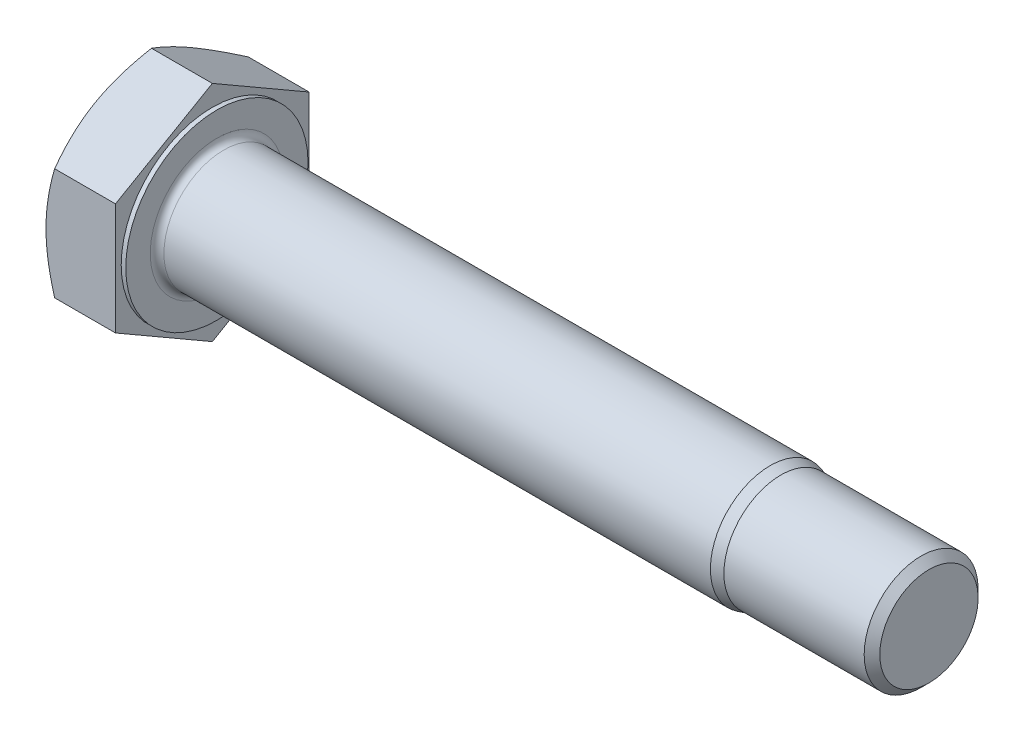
from build123d import *

# Parameters (mm, degrees)
BASEHEAD_DEPTH = 13
SKETCH4_W      = 0.8
SKETCH4_H      = 3.629909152
HEADFILLET_R   = 1.2


with BuildPart() as part:
    # HeadSke → BaseHead (new body)
    with BuildSketch(Plane(origin=(0, 0, 0), x_dir=(0, 0, -1), z_dir=(1, 0, 0))):
        Polygon((17, 9.814954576), (17, -9.814954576), (0, -19.629909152), (-17, -9.814954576), (-17, 9.814954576), (0, 19.629909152), align=None)
    extrude(amount=BASEHEAD_DEPTH)

    # BodySke → BaseBody (revolve)
    with BuildSketch(Plane.XY, mode=Mode.PRIVATE) as basebody_sk:
        Polygon((0, 10.5), (0, 0), (138, 0), (138, 8.626), (136.626, 10), (112, 10), (110.133974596, 10.5), align=None)
    revolve(basebody_sk.sketch.rotate(Axis((0, 0, 0), (1, 0, 0)), 90), axis=Axis((0, 0, 0), (1, 0, 0)))

    # Sketch3 → HeadChamfer (revolve, cut)
    with BuildSketch(Plane(origin=(0, 0, 0), x_dir=(1, 0, 0), z_dir=(0, 1, 0))):
        Polygon((4.25, 24.361215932), (-4.25, 9.638784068), (-11.424013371, 13.780702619), (-2.924013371, 28.503134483), align=None)
    revolve(axis=Axis((0, 0, 0), (1, 0, 0)), mode=Mode.SUBTRACT)

    # Sketch4 → BearingFace (revolve, cut)
    with BuildSketch(Plane.XY, mode=Mode.PRIVATE) as bearingface_sk:
        with Locations((12.6, 17.814954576)):
            Rectangle(SKETCH4_W, SKETCH4_H)
    revolve(bearingface_sk.sketch.rotate(Axis((0, 0, 0), (1, 0, 0)), 90), axis=Axis((0, 0, 0), (1, 0, 0)), mode=Mode.SUBTRACT)

    # HeadFillet
    headfillet_edges = [part.edges().sort_by_distance(p)[0] for p in [
        (13, 0, -10.5),
    ]]
    fillet(headfillet_edges, radius=HEADFILLET_R)


solid = part.part
